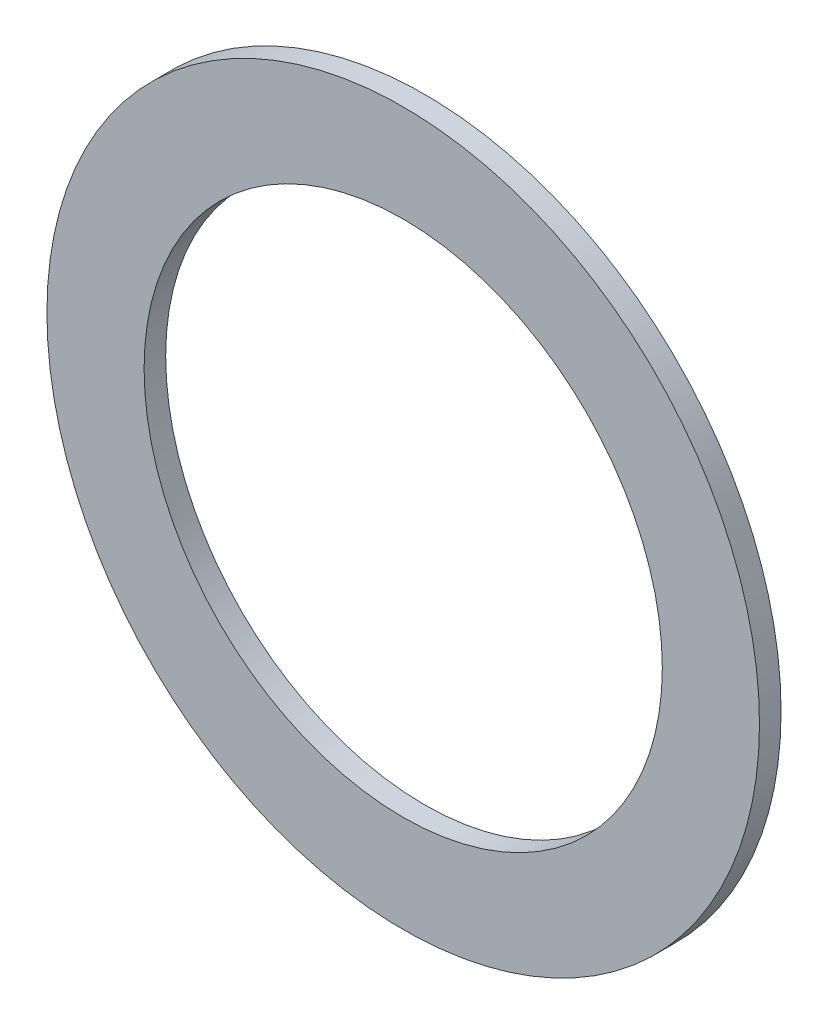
from build123d import *

# Parameters (mm, degrees)
SKETCH1_R           = 16.5
SKETCH1_R_2         = 12
BOSS_EXTRUDE1_DEPTH = 1


with BuildPart() as part:
    # Sketch1 → Boss-Extrude1 (new body)
    with BuildSketch(Plane.XY):
        Circle(SKETCH1_R)
        Circle(SKETCH1_R_2, mode=Mode.SUBTRACT)
    extrude(amount=BOSS_EXTRUDE1_DEPTH)


solid = part.part
